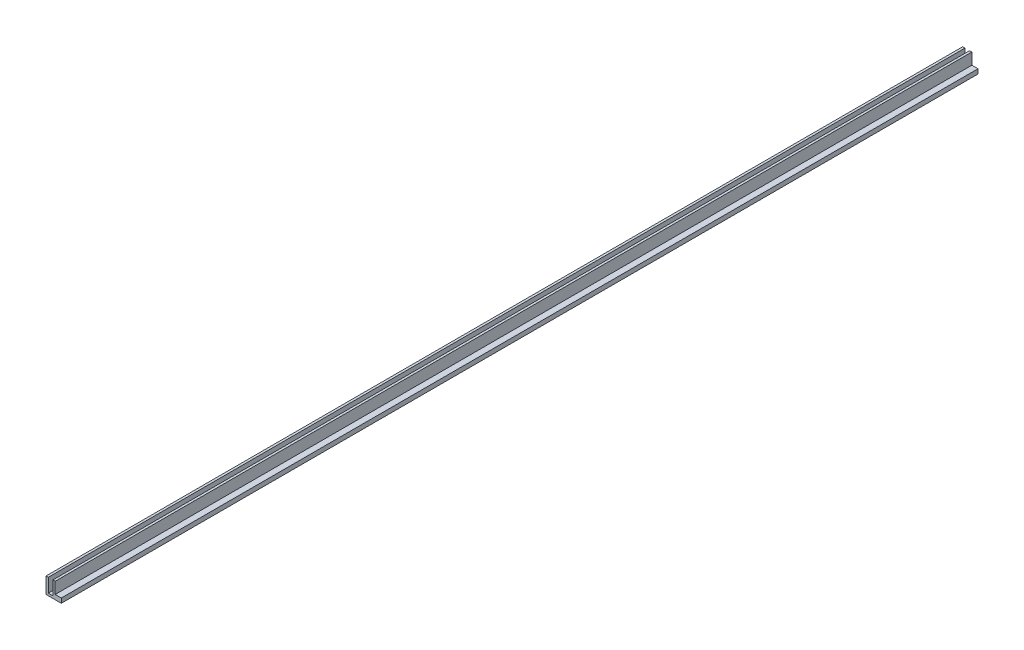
from build123d import *

# Parameters (mm, degrees)
BASE_EXTRUSION_DEPTH = 1200


with BuildPart() as part:
    # Esquisse1 → Base-Extrusion (new body)
    with BuildSketch(Plane.XY):
        Polygon((0, 0), (20, 0), (20, 6), (12, 6), (12, 21), (9, 21), (9, 3), (3, 3), (3, 21), (0, 21), align=None)
    extrude(amount=BASE_EXTRUSION_DEPTH)


solid = part.part
